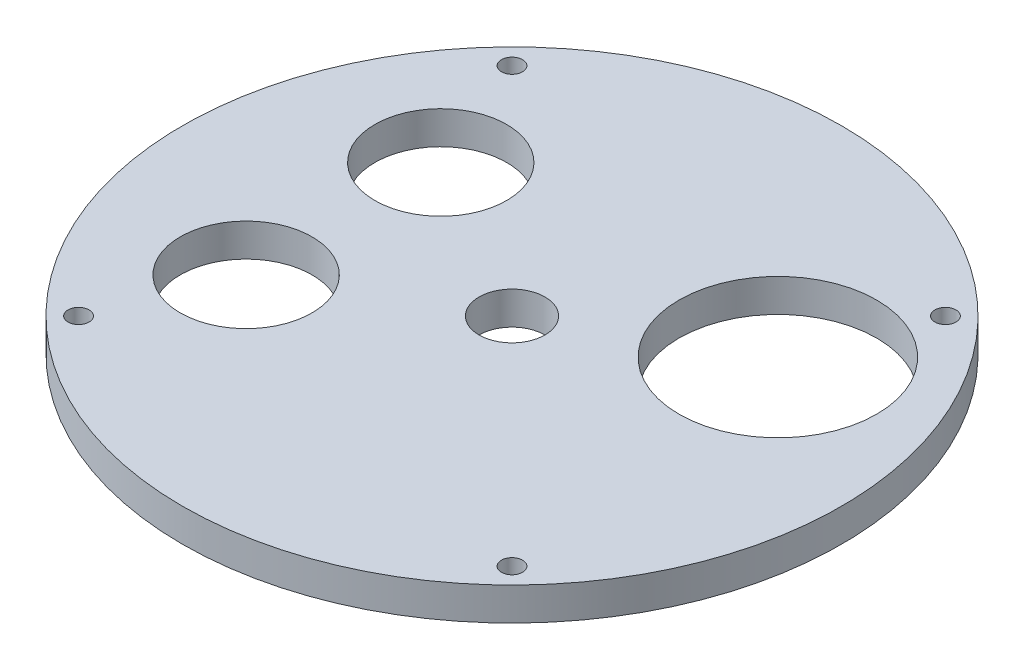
from build123d import *

# Parameters (mm, degrees)
SKETCH1_R           = 63.5
BOSS_EXTRUDE1_DEPTH = 6.35
SKETCH2_R           = 12.7
SKETCH2_R_2         = 19.05
SKETCH2_R_3         = 1.919694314
SKETCH2_R_4         = 2.032
CUT_EXTRUDE1_DEPTH  = 91.02678768
SKETCH3_R           = 6.35
CUT_EXTRUDE2_DEPTH  = 91.02678768


with BuildPart() as part:
    # Sketch1 → Boss-Extrude1 (new body)
    with BuildSketch(Plane(origin=(0, 0, 0), x_dir=(1, 0, 0), z_dir=(0, 1, 0))):
        with Locations(Location((0, 0, 0), (0, 0, 270))):
            Circle(SKETCH1_R)
    extrude(amount=BOSS_EXTRUDE1_DEPTH)

    # Sketch2 → Cut-Extrude1 (cut, through all)
    with BuildSketch(Plane(origin=(0, 6.35, 0), x_dir=(1, 0, 0), z_dir=(0, 1, 0))):
        with Locations(Location((-32.475952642, 18.75, 0), (0, 0, 270))):
            Circle(SKETCH2_R)
        with Locations(Location((32.475952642, 18.75, 0), (0, 0, 270))):
            Circle(SKETCH2_R_2)
        with Locations(Location((-32.475952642, -18.75, 0), (0, 0, 270))):
            Circle(SKETCH2_R)
        with Locations(Location((0, 0, 0), (0, 0, 270))):
            Circle(SKETCH2_R_3)
        with Locations(Location((41.758190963, -41.758190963, 0), (0, 0, 270))):
            Circle(SKETCH2_R_4)
        with Locations(Location((41.758190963, 41.758190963, 0), (0, 0, 270))):
            Circle(SKETCH2_R_4)
        with Locations(Location((-41.758190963, 41.758190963, 0), (0, 0, 90))):
            Circle(SKETCH2_R_4)
        with Locations(Location((-41.758190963, -41.758190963, 0), (0, 0, 270))):
            Circle(SKETCH2_R_4)
    extrude(amount=-CUT_EXTRUDE1_DEPTH, mode=Mode.SUBTRACT)

    # Sketch3 → Cut-Extrude2 (cut, through all)
    with BuildSketch(Plane(origin=(0, 6.35, 0), x_dir=(1, 0, 0), z_dir=(0, 1, 0))):
        with Locations(Location((0, 0, 0), (0, 0, 270))):
            Circle(SKETCH3_R)
    extrude(amount=-CUT_EXTRUDE2_DEPTH, mode=Mode.SUBTRACT)


solid = part.part
